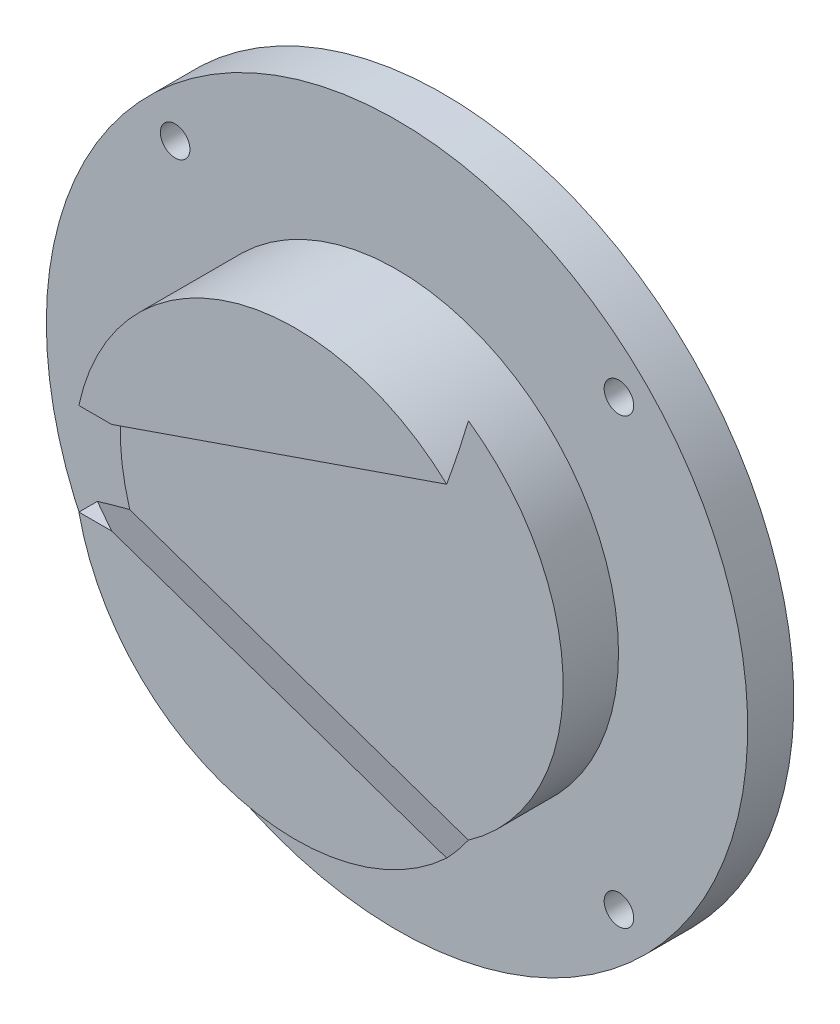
ISO-10303-21;
HEADER;
FILE_DESCRIPTION(('STEP AP214'),'2;1');
FILE_NAME('part.step','',(''),(''),'','','');
FILE_SCHEMA(('AUTOMOTIVE_DESIGN { 1 0 10303 214 1 1 1 1 }'));
ENDSEC;
DATA;
#1=APPLICATION_CONTEXT('core data for automotive mechanical design processes');
#2=APPLICATION_PROTOCOL_DEFINITION('international standard','automotive_design',2000,#1);
#3=PRODUCT_CONTEXT('',#1,'mechanical');
#4=PRODUCT('Part','Part','',(#3));
#5=PRODUCT_RELATED_PRODUCT_CATEGORY('part','',(#4));
#6=PRODUCT_DEFINITION_FORMATION('','',#4);
#7=PRODUCT_DEFINITION_CONTEXT('part definition',#1,'design');
#8=PRODUCT_DEFINITION('design','',#6,#7);
#9=PRODUCT_DEFINITION_SHAPE('','',#8);
#10=(LENGTH_UNIT() NAMED_UNIT(*) SI_UNIT(.MILLI.,.METRE.));
#11=(NAMED_UNIT(*) PLANE_ANGLE_UNIT() SI_UNIT($,.RADIAN.));
#12=(NAMED_UNIT(*) SI_UNIT($,.STERADIAN.) SOLID_ANGLE_UNIT());
#13=UNCERTAINTY_MEASURE_WITH_UNIT(LENGTH_MEASURE(1.E-05),#10,'distance_accuracy_value','');
#14=(GEOMETRIC_REPRESENTATION_CONTEXT(3) GLOBAL_UNCERTAINTY_ASSIGNED_CONTEXT((#13)) GLOBAL_UNIT_ASSIGNED_CONTEXT((#10,
#11,#12)) REPRESENTATION_CONTEXT('',''));
#15=CARTESIAN_POINT('',(0.,0.,0.));
#16=DIRECTION('',(0.,0.,1.));
#17=DIRECTION('',(1.,0.,0.));
#18=AXIS2_PLACEMENT_3D('',#15,#16,#17);
#19=CARTESIAN_POINT('',(0.,0.,18.5));
#20=DIRECTION('',(0.,0.,-1.));
#21=DIRECTION('',(1.,0.,0.));
#22=AXIS2_PLACEMENT_3D('',#19,#20,#21);
#23=CYLINDRICAL_SURFACE('',#22,46.);
#24=CARTESIAN_POINT('',(0.,0.,0.));
#25=DIRECTION('',(0.,0.,-1.));
#26=DIRECTION('',(1.,0.,0.));
#27=AXIS2_PLACEMENT_3D('',#24,#25,#26);
#28=CIRCLE('',#27,46.);
#29=CARTESIAN_POINT('',(46.,0.,0.));
#30=VERTEX_POINT('',#29);
#31=EDGE_CURVE('E155',#30,#30,#28,.T.);
#32=ORIENTED_EDGE('',*,*,#31,.T.);
#33=EDGE_LOOP('',(#32));
#34=FACE_BOUND('',#33,.T.);
#35=CARTESIAN_POINT('',(0.,0.,18.5));
#36=DIRECTION('',(0.,0.,-1.));
#37=DIRECTION('',(1.,0.,0.));
#38=AXIS2_PLACEMENT_3D('',#35,#36,#37);
#39=CIRCLE('',#38,46.);
#40=CARTESIAN_POINT('',(46.,0.,18.5));
#41=VERTEX_POINT('',#40);
#42=EDGE_CURVE('E470',#41,#41,#39,.T.);
#43=ORIENTED_EDGE('',*,*,#42,.F.);
#44=EDGE_LOOP('',(#43));
#45=FACE_BOUND('',#44,.T.);
#46=ADVANCED_FACE('F14',(#34,#45),#23,.F.);
#47=CARTESIAN_POINT('',(70.,12.5,-0.001000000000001));
#48=DIRECTION('',(0.,1.,0.));
#49=DIRECTION('',(0.,0.,1.));
#50=AXIS2_PLACEMENT_3D('',#47,#48,#49);
#51=PLANE('',#50);
#52=DIRECTION('',(0.870492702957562,0.,0.49218132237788));
#53=VECTOR('',#52,1.);
#54=CARTESIAN_POINT('',(23.8392591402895,12.5,81.6408385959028));
#55=LINE('',#54,#53);
#56=CARTESIAN_POINT('',(-58.6834729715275,12.5,34.9820357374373));
#57=VERTEX_POINT('',#56);
#58=CARTESIAN_POINT('',(-49.8084891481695,12.5,40.));
#59=VERTEX_POINT('',#58);
#60=EDGE_CURVE('E25',#57,#59,#55,.T.);
#61=ORIENTED_EDGE('',*,*,#60,.T.);
#62=DIRECTION('',(-1.,0.,0.));
#63=VECTOR('',#62,1.);
#64=CARTESIAN_POINT('',(70.,12.5,40.));
#65=LINE('',#64,#63);
#66=CARTESIAN_POINT('',(-58.6834729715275,12.5,40.));
#67=VERTEX_POINT('',#66);
#68=EDGE_CURVE('E136',#59,#67,#65,.T.);
#69=ORIENTED_EDGE('',*,*,#68,.T.);
#70=DIRECTION('',(0.,0.,1.));
#71=VECTOR('',#70,1.);
#72=CARTESIAN_POINT('',(-58.6834729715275,12.5,12.5));
#73=LINE('',#72,#71);
#74=EDGE_CURVE('E143',#57,#67,#73,.T.);
#75=ORIENTED_EDGE('',*,*,#74,.F.);
#76=EDGE_LOOP('',(#61,#69,#75));
#77=FACE_BOUND('',#76,.T.);
#78=ADVANCED_FACE('F217',(#77),#51,.F.);
#79=CARTESIAN_POINT('',(70.,-12.5,-0.001000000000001));
#80=DIRECTION('',(0.,-1.,0.));
#81=DIRECTION('',(1.,0.,0.));
#82=AXIS2_PLACEMENT_3D('',#79,#80,#81);
#83=PLANE('',#82);
#84=DIRECTION('',(1.,0.,0.));
#85=VECTOR('',#84,1.);
#86=CARTESIAN_POINT('',(70.,-12.5,40.));
#87=LINE('',#86,#85);
#88=CARTESIAN_POINT('',(-58.6834729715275,-12.5,40.));
#89=VERTEX_POINT('',#88);
#90=CARTESIAN_POINT('',(-49.8084891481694,-12.5,40.));
#91=VERTEX_POINT('',#90);
#92=EDGE_CURVE('E97',#89,#91,#87,.T.);
#93=ORIENTED_EDGE('',*,*,#92,.T.);
#94=DIRECTION('',(-0.870492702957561,0.,-0.49218132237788));
#95=VECTOR('',#94,1.);
#96=CARTESIAN_POINT('',(23.8392591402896,-12.5,81.6408385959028));
#97=LINE('',#96,#95);
#98=CARTESIAN_POINT('',(-58.6834729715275,-12.5,34.9820357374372));
#99=VERTEX_POINT('',#98);
#100=EDGE_CURVE('E103',#91,#99,#97,.T.);
#101=ORIENTED_EDGE('',*,*,#100,.T.);
#102=DIRECTION('',(0.,0.,-1.));
#103=VECTOR('',#102,1.);
#104=CARTESIAN_POINT('',(-58.6834729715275,-12.5,12.5));
#105=LINE('',#104,#103);
#106=EDGE_CURVE('E106',#89,#99,#105,.T.);
#107=ORIENTED_EDGE('',*,*,#106,.F.);
#108=EDGE_LOOP('',(#93,#101,#107));
#109=FACE_BOUND('',#108,.T.);
#110=ADVANCED_FACE('F104',(#109),#83,.F.);
#111=CARTESIAN_POINT('',(0.,0.,27.5));
#112=DIRECTION('',(0.,0.,1.));
#113=DIRECTION('',(0.,-1.,0.));
#114=AXIS2_PLACEMENT_3D('',#111,#112,#113);
#115=PLANE('',#114);
#116=CARTESIAN_POINT('',(0.,0.,27.5));
#117=DIRECTION('',(0.,0.,1.));
#118=DIRECTION('',(-1.,0.,0.));
#119=AXIS2_PLACEMENT_3D('',#116,#117,#118);
#120=CIRCLE('',#119,60.0000000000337);
#121=CARTESIAN_POINT('',(34.3447382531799,-49.1979568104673,27.5));
#122=VERTEX_POINT('',#121);
#123=CARTESIAN_POINT('',(34.3447382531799,49.1979568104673,27.5));
#124=VERTEX_POINT('',#123);
#125=EDGE_CURVE('E164',#122,#124,#120,.T.);
#126=ORIENTED_EDGE('',*,*,#125,.T.);
#127=DIRECTION('',(-0.945218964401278,-0.326436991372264,0.));
#128=VECTOR('',#127,1.);
#129=CARTESIAN_POINT('',(-11.5204343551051,33.3581466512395,27.5));
#130=LINE('',#129,#128);
#131=CARTESIAN_POINT('',(-57.3856069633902,17.5183364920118,27.5));
#132=VERTEX_POINT('',#131);
#133=EDGE_CURVE('E9',#124,#132,#130,.T.);
#134=ORIENTED_EDGE('',*,*,#133,.T.);
#135=CARTESIAN_POINT('',(0.,0.,27.5));
#136=DIRECTION('',(0.,0.,1.));
#137=DIRECTION('',(-1.,0.,0.));
#138=AXIS2_PLACEMENT_3D('',#135,#136,#137);
#139=CIRCLE('',#138,60.0000000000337);
#140=CARTESIAN_POINT('',(-57.3856069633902,-17.5183364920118,27.5));
#141=VERTEX_POINT('',#140);
#142=EDGE_CURVE('E144',#132,#141,#139,.T.);
#143=ORIENTED_EDGE('',*,*,#142,.T.);
#144=DIRECTION('',(0.945218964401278,-0.326436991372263,0.));
#145=VECTOR('',#144,1.);
#146=CARTESIAN_POINT('',(-11.5204343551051,-33.3581466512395,27.5));
#147=LINE('',#146,#145);
#148=EDGE_CURVE('E77',#141,#122,#147,.T.);
#149=ORIENTED_EDGE('',*,*,#148,.T.);
#150=EDGE_LOOP('',(#126,#134,#143,#149));
#151=FACE_BOUND('',#150,.T.);
#152=ADVANCED_FACE('F249',(#151),#115,.T.);
#153=CARTESIAN_POINT('',(-9.16457829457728,26.5366163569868,40.));
#154=DIRECTION('',(0.282702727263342,-0.818583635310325,-0.5));
#155=DIRECTION('',(0.870492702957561,0.,0.492181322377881));
#156=AXIS2_PLACEMENT_3D('',#153,#154,#155);
#157=PLANE('',#156);
#158=DIRECTION('',(-0.945218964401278,-0.326436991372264,0.));
#159=VECTOR('',#158,1.);
#160=CARTESIAN_POINT('',(-9.16457829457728,26.5366163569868,40.));
#161=LINE('',#160,#159);
#162=CARTESIAN_POINT('',(40.9571535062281,43.8464545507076,40.));
#163=VERTEX_POINT('',#162);
#164=EDGE_CURVE('E110',#163,#59,#161,.T.);
#165=ORIENTED_EDGE('',*,*,#164,.T.);
#166=ORIENTED_EDGE('',*,*,#60,.F.);
#167=CARTESIAN_POINT('',(1.28737296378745E-07,7.5251274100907E-08,88.6265822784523));
#168=DIRECTION('',(-0.282702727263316,0.81858363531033,0.500000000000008));
#169=DIRECTION('',(0.163218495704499,-0.472609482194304,0.866025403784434));
#170=AXIS2_PLACEMENT_3D('',#167,#168,#169);
#171=ELLIPSE('',#170,120.000000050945,60.0000001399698);
#172=EDGE_CURVE('E139',#132,#57,#171,.T.);
#173=ORIENTED_EDGE('',*,*,#172,.F.);
#174=ORIENTED_EDGE('',*,*,#133,.F.);
#175=CARTESIAN_POINT('',(-1.05235331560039E-08,2.49347564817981E-08,88.626582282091));
#176=DIRECTION('',(0.28270272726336,-0.818583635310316,-0.500000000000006));
#177=DIRECTION('',(0.163218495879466,-0.472609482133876,0.866025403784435));
#178=AXIS2_PLACEMENT_3D('',#175,#176,#177);
#179=ELLIPSE('',#178,119.999999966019,60.0000000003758);
#180=EDGE_CURVE('E151',#124,#163,#179,.T.);
#181=ORIENTED_EDGE('',*,*,#180,.T.);
#182=EDGE_LOOP('',(#165,#166,#173,#174,#181));
#183=FACE_BOUND('',#182,.T.);
#184=ADVANCED_FACE('F231',(#183),#157,.T.);
#185=CARTESIAN_POINT('',(-9.16457829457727,-26.5366163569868,40.));
#186=DIRECTION('',(0.282702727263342,0.818583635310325,-0.5));
#187=DIRECTION('',(0.,0.521263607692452,0.853395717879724));
#188=AXIS2_PLACEMENT_3D('',#185,#186,#187);
#189=PLANE('',#188);
#190=CARTESIAN_POINT('',(1.05149826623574E-07,-8.12960410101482E-08,88.6265822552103));
#191=DIRECTION('',(0.282702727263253,0.81858363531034,-0.500000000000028));
#192=DIRECTION('',(-0.163218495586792,-0.472609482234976,-0.866025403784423));
#193=AXIS2_PLACEMENT_3D('',#190,#191,#192);
#194=ELLIPSE('',#193,120.000000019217,60.000000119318);
#195=EDGE_CURVE('E112',#141,#99,#194,.T.);
#196=ORIENTED_EDGE('',*,*,#195,.T.);
#197=ORIENTED_EDGE('',*,*,#100,.F.);
#198=DIRECTION('',(0.945218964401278,-0.326436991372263,0.));
#199=VECTOR('',#198,1.);
#200=CARTESIAN_POINT('',(-9.16457829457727,-26.5366163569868,40.));
#201=LINE('',#200,#199);
#202=CARTESIAN_POINT('',(40.9571535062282,-43.8464545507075,40.));
#203=VERTEX_POINT('',#202);
#204=EDGE_CURVE('E134',#91,#203,#201,.T.);
#205=ORIENTED_EDGE('',*,*,#204,.T.);
#206=CARTESIAN_POINT('',(-1.90038029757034E-08,-1.45399603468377E-08,88.6265822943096));
#207=DIRECTION('',(-0.282702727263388,-0.818583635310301,0.500000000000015));
#208=DIRECTION('',(-0.163218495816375,-0.472609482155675,-0.86602540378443));
#209=AXIS2_PLACEMENT_3D('',#206,#207,#208);
#210=ELLIPSE('',#209,119.999999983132,60.0000000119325);
#211=EDGE_CURVE('E129',#122,#203,#210,.T.);
#212=ORIENTED_EDGE('',*,*,#211,.F.);
#213=ORIENTED_EDGE('',*,*,#148,.F.);
#214=EDGE_LOOP('',(#196,#197,#205,#212,#213));
#215=FACE_BOUND('',#214,.T.);
#216=ADVANCED_FACE('F113',(#215),#189,.T.);
#217=CARTESIAN_POINT('',(0.,0.,0.));
#218=DIRECTION('',(0.,0.,-1.));
#219=DIRECTION('',(1.,0.,0.));
#220=AXIS2_PLACEMENT_3D('',#217,#218,#219);
#221=PLANE('',#220);
#222=CARTESIAN_POINT('',(-60.1040764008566,60.1040764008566,0.));
#223=DIRECTION('',(0.,0.,-1.));
#224=DIRECTION('',(1.,0.,0.));
#225=AXIS2_PLACEMENT_3D('',#222,#223,#224);
#226=CIRCLE('',#225,4.);
#227=CARTESIAN_POINT('',(-56.1040764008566,60.1040764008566,0.));
#228=VERTEX_POINT('',#227);
#229=EDGE_CURVE('E473',#228,#228,#226,.T.);
#230=ORIENTED_EDGE('',*,*,#229,.F.);
#231=EDGE_LOOP('',(#230));
#232=FACE_BOUND('',#231,.T.);
#233=CARTESIAN_POINT('',(60.1040764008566,-60.1040764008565,0.));
#234=DIRECTION('',(0.,0.,-1.));
#235=DIRECTION('',(1.,0.,0.));
#236=AXIS2_PLACEMENT_3D('',#233,#234,#235);
#237=CIRCLE('',#236,4.);
#238=CARTESIAN_POINT('',(64.1040764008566,-60.1040764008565,0.));
#239=VERTEX_POINT('',#238);
#240=EDGE_CURVE('E469',#239,#239,#237,.T.);
#241=ORIENTED_EDGE('',*,*,#240,.F.);
#242=EDGE_LOOP('',(#241));
#243=FACE_BOUND('',#242,.T.);
#244=CARTESIAN_POINT('',(60.1040764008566,60.1040764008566,0.));
#245=DIRECTION('',(0.,0.,-1.));
#246=DIRECTION('',(1.,0.,0.));
#247=AXIS2_PLACEMENT_3D('',#244,#245,#246);
#248=CIRCLE('',#247,4.);
#249=CARTESIAN_POINT('',(64.1040764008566,60.1040764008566,0.));
#250=VERTEX_POINT('',#249);
#251=EDGE_CURVE('E455',#250,#250,#248,.T.);
#252=ORIENTED_EDGE('',*,*,#251,.F.);
#253=EDGE_LOOP('',(#252));
#254=FACE_BOUND('',#253,.T.);
#255=CARTESIAN_POINT('',(-60.1040764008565,-60.1040764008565,0.));
#256=DIRECTION('',(0.,0.,-1.));
#257=DIRECTION('',(1.,0.,0.));
#258=AXIS2_PLACEMENT_3D('',#255,#256,#257);
#259=CIRCLE('',#258,4.);
#260=CARTESIAN_POINT('',(-56.1040764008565,-60.1040764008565,0.));
#261=VERTEX_POINT('',#260);
#262=EDGE_CURVE('E187',#261,#261,#259,.T.);
#263=ORIENTED_EDGE('',*,*,#262,.F.);
#264=EDGE_LOOP('',(#263));
#265=FACE_BOUND('',#264,.T.);
#266=ORIENTED_EDGE('',*,*,#31,.F.);
#267=EDGE_LOOP('',(#266));
#268=FACE_BOUND('',#267,.T.);
#269=CARTESIAN_POINT('',(0.,0.,0.));
#270=DIRECTION('',(0.,0.,-1.));
#271=DIRECTION('',(1.,0.,0.));
#272=AXIS2_PLACEMENT_3D('',#269,#270,#271);
#273=CIRCLE('',#272,95.);
#274=CARTESIAN_POINT('',(-95.,0.,0.));
#275=VERTEX_POINT('',#274);
#276=EDGE_CURVE('E152',#275,#275,#273,.T.);
#277=ORIENTED_EDGE('',*,*,#276,.T.);
#278=EDGE_LOOP('',(#277));
#279=FACE_BOUND('',#278,.T.);
#280=ADVANCED_FACE('F230',(#232,#243,#254,#265,#268,#279),#221,.T.);
#281=CARTESIAN_POINT('',(0.,0.,40.));
#282=DIRECTION('',(0.,0.,1.));
#283=DIRECTION('',(0.,-1.,0.));
#284=AXIS2_PLACEMENT_3D('',#281,#282,#283);
#285=PLANE('',#284);
#286=CARTESIAN_POINT('',(0.,0.,40.));
#287=DIRECTION('',(0.,0.,1.));
#288=DIRECTION('',(-1.,0.,0.));
#289=AXIS2_PLACEMENT_3D('',#286,#287,#288);
#290=CIRCLE('',#289,60.);
#291=EDGE_CURVE('E148',#163,#67,#290,.T.);
#292=ORIENTED_EDGE('',*,*,#291,.T.);
#293=ORIENTED_EDGE('',*,*,#68,.F.);
#294=ORIENTED_EDGE('',*,*,#164,.F.);
#295=EDGE_LOOP('',(#292,#293,#294));
#296=FACE_BOUND('',#295,.T.);
#297=ADVANCED_FACE('F235',(#296),#285,.T.);
#298=CARTESIAN_POINT('',(0.,0.,40.));
#299=DIRECTION('',(0.,0.,1.));
#300=DIRECTION('',(0.,-1.,0.));
#301=AXIS2_PLACEMENT_3D('',#298,#299,#300);
#302=PLANE('',#301);
#303=CARTESIAN_POINT('',(0.,0.,40.));
#304=DIRECTION('',(0.,0.,1.));
#305=DIRECTION('',(-1.,0.,0.));
#306=AXIS2_PLACEMENT_3D('',#303,#304,#305);
#307=CIRCLE('',#306,60.);
#308=EDGE_CURVE('E122',#89,#203,#307,.T.);
#309=ORIENTED_EDGE('',*,*,#308,.T.);
#310=ORIENTED_EDGE('',*,*,#204,.F.);
#311=ORIENTED_EDGE('',*,*,#92,.F.);
#312=EDGE_LOOP('',(#309,#310,#311));
#313=FACE_BOUND('',#312,.T.);
#314=ADVANCED_FACE('F245',(#313),#302,.T.);
#315=CARTESIAN_POINT('',(0.,0.,12.5));
#316=DIRECTION('',(0.,0.,-1.));
#317=DIRECTION('',(1.,0.,0.));
#318=AXIS2_PLACEMENT_3D('',#315,#316,#317);
#319=PLANE('',#318);
#320=CARTESIAN_POINT('',(-60.1040764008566,60.1040764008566,12.5));
#321=DIRECTION('',(0.,0.,-1.));
#322=DIRECTION('',(1.,0.,0.));
#323=AXIS2_PLACEMENT_3D('',#320,#321,#322);
#324=CIRCLE('',#323,4.);
#325=CARTESIAN_POINT('',(-56.1040764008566,60.1040764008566,12.5));
#326=VERTEX_POINT('',#325);
#327=EDGE_CURVE('E18',#326,#326,#324,.T.);
#328=ORIENTED_EDGE('',*,*,#327,.T.);
#329=EDGE_LOOP('',(#328));
#330=FACE_BOUND('',#329,.T.);
#331=CARTESIAN_POINT('',(60.1040764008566,-60.1040764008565,12.5));
#332=DIRECTION('',(0.,0.,-1.));
#333=DIRECTION('',(1.,0.,0.));
#334=AXIS2_PLACEMENT_3D('',#331,#332,#333);
#335=CIRCLE('',#334,4.);
#336=CARTESIAN_POINT('',(64.1040764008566,-60.1040764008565,12.5));
#337=VERTEX_POINT('',#336);
#338=EDGE_CURVE('E189',#337,#337,#335,.T.);
#339=ORIENTED_EDGE('',*,*,#338,.T.);
#340=EDGE_LOOP('',(#339));
#341=FACE_BOUND('',#340,.T.);
#342=CARTESIAN_POINT('',(60.1040764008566,60.1040764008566,12.5));
#343=DIRECTION('',(0.,0.,-1.));
#344=DIRECTION('',(1.,0.,0.));
#345=AXIS2_PLACEMENT_3D('',#342,#343,#344);
#346=CIRCLE('',#345,4.);
#347=CARTESIAN_POINT('',(64.1040764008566,60.1040764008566,12.5));
#348=VERTEX_POINT('',#347);
#349=EDGE_CURVE('E186',#348,#348,#346,.T.);
#350=ORIENTED_EDGE('',*,*,#349,.T.);
#351=EDGE_LOOP('',(#350));
#352=FACE_BOUND('',#351,.T.);
#353=CARTESIAN_POINT('',(-60.1040764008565,-60.1040764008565,12.5));
#354=DIRECTION('',(0.,0.,-1.));
#355=DIRECTION('',(1.,0.,0.));
#356=AXIS2_PLACEMENT_3D('',#353,#354,#355);
#357=CIRCLE('',#356,4.);
#358=CARTESIAN_POINT('',(-56.1040764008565,-60.1040764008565,12.5));
#359=VERTEX_POINT('',#358);
#360=EDGE_CURVE('E183',#359,#359,#357,.T.);
#361=ORIENTED_EDGE('',*,*,#360,.T.);
#362=EDGE_LOOP('',(#361));
#363=FACE_BOUND('',#362,.T.);
#364=CARTESIAN_POINT('',(0.,0.,12.5));
#365=DIRECTION('',(0.,0.,1.));
#366=DIRECTION('',(1.,0.,0.));
#367=AXIS2_PLACEMENT_3D('',#364,#365,#366);
#368=CIRCLE('',#367,60.);
#369=CARTESIAN_POINT('',(60.,0.,12.5));
#370=VERTEX_POINT('',#369);
#371=EDGE_CURVE('E147',#370,#370,#368,.T.);
#372=ORIENTED_EDGE('',*,*,#371,.F.);
#373=EDGE_LOOP('',(#372));
#374=FACE_BOUND('',#373,.T.);
#375=CARTESIAN_POINT('',(0.,0.,12.5));
#376=DIRECTION('',(0.,0.,-1.));
#377=DIRECTION('',(1.,0.,0.));
#378=AXIS2_PLACEMENT_3D('',#375,#376,#377);
#379=CIRCLE('',#378,95.);
#380=CARTESIAN_POINT('',(-95.,0.,12.5));
#381=VERTEX_POINT('',#380);
#382=EDGE_CURVE('E154',#381,#381,#379,.T.);
#383=ORIENTED_EDGE('',*,*,#382,.F.);
#384=EDGE_LOOP('',(#383));
#385=FACE_BOUND('',#384,.T.);
#386=ADVANCED_FACE('F16',(#330,#341,#352,#363,#374,#385),#319,.F.);
#387=CARTESIAN_POINT('',(0.,0.,12.5));
#388=DIRECTION('',(0.,0.,1.));
#389=DIRECTION('',(-1.,0.,0.));
#390=AXIS2_PLACEMENT_3D('',#387,#388,#389);
#391=CYLINDRICAL_SURFACE('',#390,60.);
#392=ORIENTED_EDGE('',*,*,#211,.T.);
#393=ORIENTED_EDGE('',*,*,#308,.F.);
#394=ORIENTED_EDGE('',*,*,#106,.T.);
#395=ORIENTED_EDGE('',*,*,#195,.F.);
#396=ORIENTED_EDGE('',*,*,#142,.F.);
#397=ORIENTED_EDGE('',*,*,#172,.T.);
#398=ORIENTED_EDGE('',*,*,#74,.T.);
#399=ORIENTED_EDGE('',*,*,#291,.F.);
#400=ORIENTED_EDGE('',*,*,#180,.F.);
#401=ORIENTED_EDGE('',*,*,#125,.F.);
#402=EDGE_LOOP('',(#392,#393,#394,#395,#396,#397,#398,#399,#400,#401));
#403=FACE_BOUND('',#402,.T.);
#404=ORIENTED_EDGE('',*,*,#371,.T.);
#405=EDGE_LOOP('',(#404));
#406=FACE_BOUND('',#405,.T.);
#407=ADVANCED_FACE('F120',(#403,#406),#391,.T.);
#408=CARTESIAN_POINT('',(0.,0.,0.));
#409=DIRECTION('',(0.,0.,1.));
#410=DIRECTION('',(-1.,0.,0.));
#411=AXIS2_PLACEMENT_3D('',#408,#409,#410);
#412=CYLINDRICAL_SURFACE('',#411,95.);
#413=ORIENTED_EDGE('',*,*,#382,.T.);
#414=EDGE_LOOP('',(#413));
#415=FACE_BOUND('',#414,.T.);
#416=ORIENTED_EDGE('',*,*,#276,.F.);
#417=EDGE_LOOP('',(#416));
#418=FACE_BOUND('',#417,.T.);
#419=ADVANCED_FACE('F237',(#415,#418),#412,.T.);
#420=CARTESIAN_POINT('',(-60.1040764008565,-60.1040764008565,22.));
#421=DIRECTION('',(0.,0.,-1.));
#422=DIRECTION('',(1.,0.,0.));
#423=AXIS2_PLACEMENT_3D('',#420,#421,#422);
#424=CYLINDRICAL_SURFACE('',#423,4.);
#425=ORIENTED_EDGE('',*,*,#262,.T.);
#426=EDGE_LOOP('',(#425));
#427=FACE_BOUND('',#426,.T.);
#428=ORIENTED_EDGE('',*,*,#360,.F.);
#429=EDGE_LOOP('',(#428));
#430=FACE_BOUND('',#429,.T.);
#431=ADVANCED_FACE('F228',(#427,#430),#424,.F.);
#432=CARTESIAN_POINT('',(60.1040764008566,60.1040764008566,22.));
#433=DIRECTION('',(0.,0.,-1.));
#434=DIRECTION('',(1.,0.,0.));
#435=AXIS2_PLACEMENT_3D('',#432,#433,#434);
#436=CYLINDRICAL_SURFACE('',#435,4.);
#437=ORIENTED_EDGE('',*,*,#251,.T.);
#438=EDGE_LOOP('',(#437));
#439=FACE_BOUND('',#438,.T.);
#440=ORIENTED_EDGE('',*,*,#349,.F.);
#441=EDGE_LOOP('',(#440));
#442=FACE_BOUND('',#441,.T.);
#443=ADVANCED_FACE('F211',(#439,#442),#436,.F.);
#444=CARTESIAN_POINT('',(60.1040764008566,-60.1040764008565,22.));
#445=DIRECTION('',(0.,0.,-1.));
#446=DIRECTION('',(1.,0.,0.));
#447=AXIS2_PLACEMENT_3D('',#444,#445,#446);
#448=CYLINDRICAL_SURFACE('',#447,4.);
#449=ORIENTED_EDGE('',*,*,#240,.T.);
#450=EDGE_LOOP('',(#449));
#451=FACE_BOUND('',#450,.T.);
#452=ORIENTED_EDGE('',*,*,#338,.F.);
#453=EDGE_LOOP('',(#452));
#454=FACE_BOUND('',#453,.T.);
#455=ADVANCED_FACE('F200',(#451,#454),#448,.F.);
#456=CARTESIAN_POINT('',(-60.1040764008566,60.1040764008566,22.));
#457=DIRECTION('',(0.,0.,-1.));
#458=DIRECTION('',(1.,0.,0.));
#459=AXIS2_PLACEMENT_3D('',#456,#457,#458);
#460=CYLINDRICAL_SURFACE('',#459,4.);
#461=ORIENTED_EDGE('',*,*,#229,.T.);
#462=EDGE_LOOP('',(#461));
#463=FACE_BOUND('',#462,.T.);
#464=ORIENTED_EDGE('',*,*,#327,.F.);
#465=EDGE_LOOP('',(#464));
#466=FACE_BOUND('',#465,.T.);
#467=ADVANCED_FACE('F197',(#463,#466),#460,.F.);
#468=CARTESIAN_POINT('',(0.,0.,18.5));
#469=DIRECTION('',(0.,0.,-1.));
#470=DIRECTION('',(1.,0.,0.));
#471=AXIS2_PLACEMENT_3D('',#468,#469,#470);
#472=PLANE('',#471);
#473=ORIENTED_EDGE('',*,*,#42,.T.);
#474=EDGE_LOOP('',(#473));
#475=FACE_BOUND('',#474,.T.);
#476=ADVANCED_FACE('F199',(#475),#472,.T.);
#477=CLOSED_SHELL('',(#46,#78,#110,#152,#184,#216,#280,#297,#314,#386,#407,#419,#431,#443,#455,
#467,#476));
#478=MANIFOLD_SOLID_BREP('B1',#477);
#479=ADVANCED_BREP_SHAPE_REPRESENTATION('',(#18,#478),#14);
#480=SHAPE_DEFINITION_REPRESENTATION(#9,#479);
ENDSEC;
END-ISO-10303-21;
